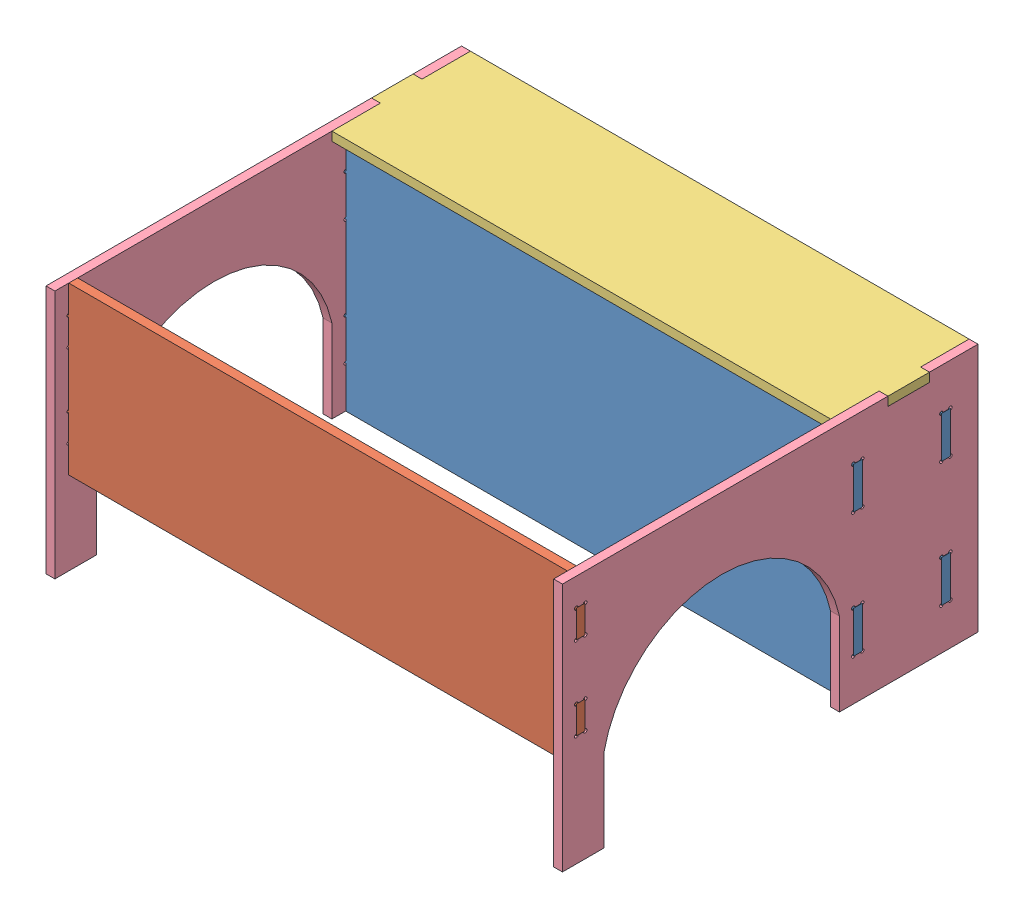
SolidWorks assembly Table.SLDASM, configuration Default (file format 9000). Lengths in mm.
Overall size (947.36 457.35 762).
6 component instances, 4 part files, 5 mates.
Components (placement in the parent):
- Base-4: Base.SLDPRT [Default] at (-377.1923 802.2596 -204.592) x (1 0 0) z (0 -1 0) size (947.36 16.3 440.9)
- Base-5: Base.SLDPRT [Default] at (-377.1923 802.2596 -43.092) x (1 0 0) z (0 -1 0) size (947.36 16.3 440.9)
- Foot-2: Foot.SLDPRT [Default] at (-317.6654 924.143 464.908) x (1 0 0) z (0 -1 0) size (947 16.3 304.8)
- Front-3: Front.SLDPRT [Default] at (-317.6654 1167.9664 -20.6686) size (947 16.3 254)
- Side-5: Side.SLDPRT [Default] at (-377.0374 727.0664 506.608) x (0 1 0) z (0 0 1) size (457.2 16.3 762)
- Side-6: Side.SLDPRT [Default] at (553.6626 727.0664 506.608) x (0 1 0) z (0 0 1) size (457.2 16.3 762)
Mates (geometry in assembly coordinates):
- Coincident2: coincident: moEndPointRef_w of Front-3; moEndPointRef_w of Side-6
- Coincident3: coincident: moEndPointRef_w of Front-3; moEndPointRef_w of Side-5
- Coincident4: coincident: moEndPointRef_w of Base-4; moEndPointRef_w of Side-5
- Coincident5: coincident: moEndPointRef_w of Base-5; moEndPointRef_w of Side-5
- Coincident6: coincident: moEndPointRef_w of Foot-2; moEndPointRef_w of Side-6
